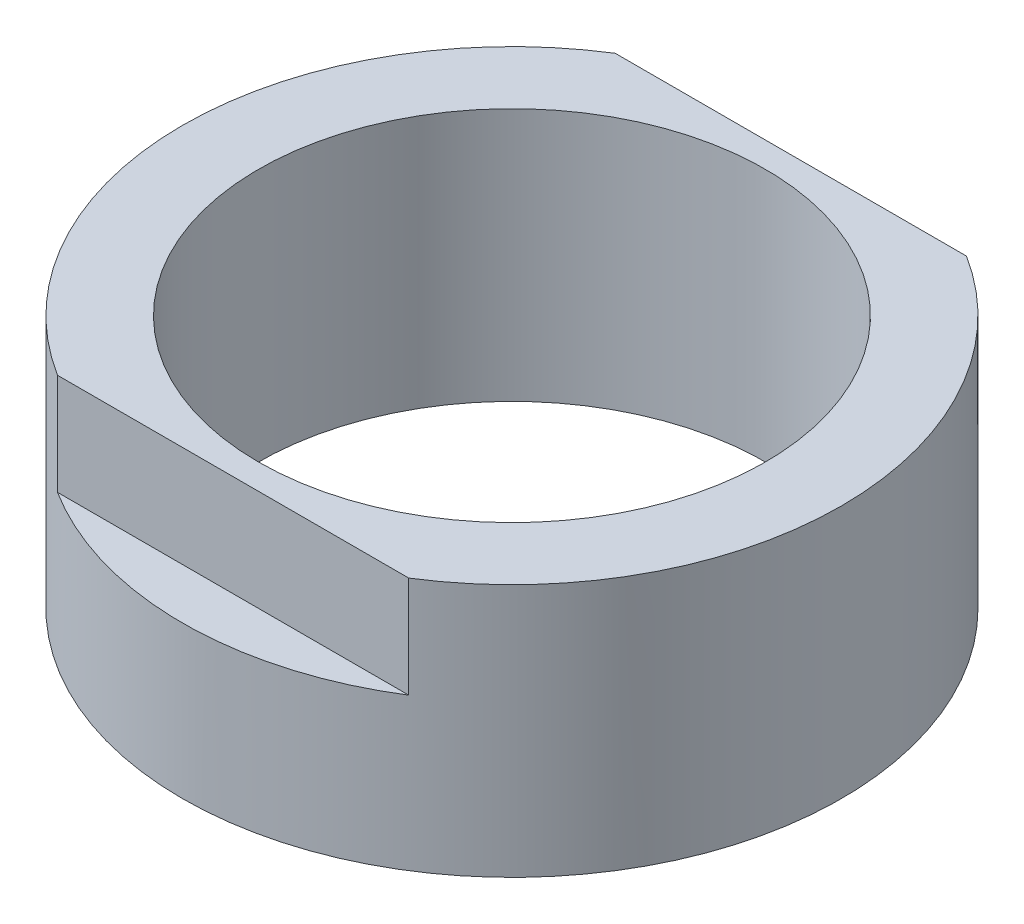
ISO-10303-21;
HEADER;
FILE_DESCRIPTION(('STEP AP214'),'2;1');
FILE_NAME('part.step','',(''),(''),'','','');
FILE_SCHEMA(('AUTOMOTIVE_DESIGN { 1 0 10303 214 1 1 1 1 }'));
ENDSEC;
DATA;
#1=APPLICATION_CONTEXT('core data for automotive mechanical design processes');
#2=APPLICATION_PROTOCOL_DEFINITION('international standard','automotive_design',2000,#1);
#3=PRODUCT_CONTEXT('',#1,'mechanical');
#4=PRODUCT('Part','Part','',(#3));
#5=PRODUCT_RELATED_PRODUCT_CATEGORY('part','',(#4));
#6=PRODUCT_DEFINITION_FORMATION('','',#4);
#7=PRODUCT_DEFINITION_CONTEXT('part definition',#1,'design');
#8=PRODUCT_DEFINITION('design','',#6,#7);
#9=PRODUCT_DEFINITION_SHAPE('','',#8);
#10=(LENGTH_UNIT() NAMED_UNIT(*) SI_UNIT(.MILLI.,.METRE.));
#11=(NAMED_UNIT(*) PLANE_ANGLE_UNIT() SI_UNIT($,.RADIAN.));
#12=(NAMED_UNIT(*) SI_UNIT($,.STERADIAN.) SOLID_ANGLE_UNIT());
#13=UNCERTAINTY_MEASURE_WITH_UNIT(LENGTH_MEASURE(1.E-05),#10,'distance_accuracy_value','');
#14=(GEOMETRIC_REPRESENTATION_CONTEXT(3) GLOBAL_UNCERTAINTY_ASSIGNED_CONTEXT((#13)) GLOBAL_UNIT_ASSIGNED_CONTEXT((#10,
#11,#12)) REPRESENTATION_CONTEXT('',''));
#15=CARTESIAN_POINT('',(0.,0.,0.));
#16=DIRECTION('',(0.,0.,1.));
#17=DIRECTION('',(1.,0.,0.));
#18=AXIS2_PLACEMENT_3D('',#15,#16,#17);
#19=CARTESIAN_POINT('',(0.,5.,0.));
#20=DIRECTION('',(0.,-1.,0.));
#21=DIRECTION('',(0.,0.,-1.));
#22=AXIS2_PLACEMENT_3D('',#19,#20,#21);
#23=CYLINDRICAL_SURFACE('',#22,6.5);
#24=CARTESIAN_POINT('',(0.,5.,0.));
#25=DIRECTION('',(0.,1.,0.));
#26=DIRECTION('',(0.,0.,1.));
#27=AXIS2_PLACEMENT_3D('',#24,#25,#26);
#28=CIRCLE('',#27,6.5);
#29=CARTESIAN_POINT('',(3.46410161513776,5.,5.5));
#30=VERTEX_POINT('',#29);
#31=CARTESIAN_POINT('',(3.46410161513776,5.,-5.5));
#32=VERTEX_POINT('',#31);
#33=EDGE_CURVE('E90',#30,#32,#28,.T.);
#34=ORIENTED_EDGE('',*,*,#33,.F.);
#35=DIRECTION('',(0.,-1.,0.));
#36=VECTOR('',#35,1.);
#37=CARTESIAN_POINT('',(3.46410161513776,5.,5.5));
#38=LINE('',#37,#36);
#39=CARTESIAN_POINT('',(3.46410161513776,3.,5.5));
#40=VERTEX_POINT('',#39);
#41=EDGE_CURVE('E48',#30,#40,#38,.T.);
#42=ORIENTED_EDGE('',*,*,#41,.T.);
#43=CARTESIAN_POINT('',(0.,3.,0.));
#44=DIRECTION('',(0.,1.,0.));
#45=DIRECTION('',(0.,0.,1.));
#46=AXIS2_PLACEMENT_3D('',#43,#44,#45);
#47=CIRCLE('',#46,6.5);
#48=CARTESIAN_POINT('',(-3.46410161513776,3.,5.5));
#49=VERTEX_POINT('',#48);
#50=EDGE_CURVE('E11',#49,#40,#47,.T.);
#51=ORIENTED_EDGE('',*,*,#50,.F.);
#52=DIRECTION('',(0.,-1.,0.));
#53=VECTOR('',#52,1.);
#54=CARTESIAN_POINT('',(-3.46410161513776,5.,5.5));
#55=LINE('',#54,#53);
#56=CARTESIAN_POINT('',(-3.46410161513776,5.,5.5));
#57=VERTEX_POINT('',#56);
#58=EDGE_CURVE('E75',#49,#57,#55,.F.);
#59=ORIENTED_EDGE('',*,*,#58,.T.);
#60=CARTESIAN_POINT('',(-3.46410161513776,5.,-5.5));
#61=VERTEX_POINT('',#60);
#62=EDGE_CURVE('E85',#61,#57,#28,.T.);
#63=ORIENTED_EDGE('',*,*,#62,.F.);
#64=DIRECTION('',(0.,-1.,0.));
#65=VECTOR('',#64,1.);
#66=CARTESIAN_POINT('',(-3.46410161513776,5.,-5.5));
#67=LINE('',#66,#65);
#68=CARTESIAN_POINT('',(-3.46410161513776,3.,-5.5));
#69=VERTEX_POINT('',#68);
#70=EDGE_CURVE('E56',#61,#69,#67,.T.);
#71=ORIENTED_EDGE('',*,*,#70,.T.);
#72=CARTESIAN_POINT('',(0.,3.,0.));
#73=DIRECTION('',(0.,1.,0.));
#74=DIRECTION('',(0.,0.,1.));
#75=AXIS2_PLACEMENT_3D('',#72,#73,#74);
#76=CIRCLE('',#75,6.5);
#77=CARTESIAN_POINT('',(3.46410161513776,3.,-5.5));
#78=VERTEX_POINT('',#77);
#79=EDGE_CURVE('E80',#78,#69,#76,.T.);
#80=ORIENTED_EDGE('',*,*,#79,.F.);
#81=DIRECTION('',(0.,-1.,0.));
#82=VECTOR('',#81,1.);
#83=CARTESIAN_POINT('',(3.46410161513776,5.,-5.5));
#84=LINE('',#83,#82);
#85=EDGE_CURVE('E106',#78,#32,#84,.F.);
#86=ORIENTED_EDGE('',*,*,#85,.T.);
#87=EDGE_LOOP('',(#34,#42,#51,#59,#63,#71,#80,#86));
#88=FACE_BOUND('',#87,.T.);
#89=CARTESIAN_POINT('',(0.,0.,0.));
#90=DIRECTION('',(0.,1.,0.));
#91=DIRECTION('',(0.,0.,1.));
#92=AXIS2_PLACEMENT_3D('',#89,#90,#91);
#93=CIRCLE('',#92,6.5);
#94=CARTESIAN_POINT('',(0.,0.,6.5));
#95=VERTEX_POINT('',#94);
#96=EDGE_CURVE('E93',#95,#95,#93,.T.);
#97=ORIENTED_EDGE('',*,*,#96,.T.);
#98=EDGE_LOOP('',(#97));
#99=FACE_BOUND('',#98,.T.);
#100=ADVANCED_FACE('F34',(#88,#99),#23,.T.);
#101=CARTESIAN_POINT('',(0.,5.,0.));
#102=DIRECTION('',(0.,1.,0.));
#103=DIRECTION('',(0.,0.,1.));
#104=AXIS2_PLACEMENT_3D('',#101,#102,#103);
#105=PLANE('',#104);
#106=CARTESIAN_POINT('',(0.,5.,0.));
#107=DIRECTION('',(0.,1.,0.));
#108=DIRECTION('',(0.,0.,1.));
#109=AXIS2_PLACEMENT_3D('',#106,#107,#108);
#110=CIRCLE('',#109,5.);
#111=CARTESIAN_POINT('',(0.,5.,5.));
#112=VERTEX_POINT('',#111);
#113=EDGE_CURVE('E112',#112,#112,#110,.T.);
#114=ORIENTED_EDGE('',*,*,#113,.F.);
#115=EDGE_LOOP('',(#114));
#116=FACE_BOUND('',#115,.T.);
#117=DIRECTION('',(-1.,0.,0.));
#118=VECTOR('',#117,1.);
#119=CARTESIAN_POINT('',(0.,5.,5.5));
#120=LINE('',#119,#118);
#121=EDGE_CURVE('E41',#30,#57,#120,.T.);
#122=ORIENTED_EDGE('',*,*,#121,.F.);
#123=ORIENTED_EDGE('',*,*,#33,.T.);
#124=DIRECTION('',(1.,0.,0.));
#125=VECTOR('',#124,1.);
#126=CARTESIAN_POINT('',(0.,5.,-5.5));
#127=LINE('',#126,#125);
#128=EDGE_CURVE('E89',#61,#32,#127,.T.);
#129=ORIENTED_EDGE('',*,*,#128,.F.);
#130=ORIENTED_EDGE('',*,*,#62,.T.);
#131=EDGE_LOOP('',(#122,#123,#129,#130));
#132=FACE_BOUND('',#131,.T.);
#133=ADVANCED_FACE('F88',(#116,#132),#105,.T.);
#134=CARTESIAN_POINT('',(0.,0.,0.));
#135=DIRECTION('',(0.,1.,0.));
#136=DIRECTION('',(0.,0.,1.));
#137=AXIS2_PLACEMENT_3D('',#134,#135,#136);
#138=PLANE('',#137);
#139=CARTESIAN_POINT('',(0.,0.,0.));
#140=DIRECTION('',(0.,1.,0.));
#141=DIRECTION('',(0.,0.,1.));
#142=AXIS2_PLACEMENT_3D('',#139,#140,#141);
#143=CIRCLE('',#142,5.);
#144=CARTESIAN_POINT('',(0.,0.,5.));
#145=VERTEX_POINT('',#144);
#146=EDGE_CURVE('E111',#145,#145,#143,.T.);
#147=ORIENTED_EDGE('',*,*,#146,.T.);
#148=EDGE_LOOP('',(#147));
#149=FACE_BOUND('',#148,.T.);
#150=ORIENTED_EDGE('',*,*,#96,.F.);
#151=EDGE_LOOP('',(#150));
#152=FACE_BOUND('',#151,.T.);
#153=ADVANCED_FACE('F118',(#149,#152),#138,.F.);
#154=CARTESIAN_POINT('',(-5.66854749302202,3.,-5.5));
#155=DIRECTION('',(0.,1.,0.));
#156=DIRECTION('',(0.,0.,1.));
#157=AXIS2_PLACEMENT_3D('',#154,#155,#156);
#158=PLANE('',#157);
#159=ORIENTED_EDGE('',*,*,#79,.T.);
#160=DIRECTION('',(1.,0.,0.));
#161=VECTOR('',#160,1.);
#162=CARTESIAN_POINT('',(-5.66854749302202,3.,-5.5));
#163=LINE('',#162,#161);
#164=EDGE_CURVE('E103',#69,#78,#163,.T.);
#165=ORIENTED_EDGE('',*,*,#164,.T.);
#166=EDGE_LOOP('',(#159,#165));
#167=FACE_BOUND('',#166,.T.);
#168=ADVANCED_FACE('F102',(#167),#158,.T.);
#169=CARTESIAN_POINT('',(-5.66854749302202,3.,-5.5));
#170=DIRECTION('',(0.,0.,1.));
#171=DIRECTION('',(1.,0.,0.));
#172=AXIS2_PLACEMENT_3D('',#169,#170,#171);
#173=PLANE('',#172);
#174=ORIENTED_EDGE('',*,*,#128,.T.);
#175=ORIENTED_EDGE('',*,*,#85,.F.);
#176=ORIENTED_EDGE('',*,*,#164,.F.);
#177=ORIENTED_EDGE('',*,*,#70,.F.);
#178=EDGE_LOOP('',(#174,#175,#176,#177));
#179=FACE_BOUND('',#178,.T.);
#180=ADVANCED_FACE('F105',(#179),#173,.F.);
#181=CARTESIAN_POINT('',(-5.40170878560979,3.,8.5));
#182=DIRECTION('',(0.,1.,0.));
#183=DIRECTION('',(0.,0.,1.));
#184=AXIS2_PLACEMENT_3D('',#181,#182,#183);
#185=PLANE('',#184);
#186=ORIENTED_EDGE('',*,*,#50,.T.);
#187=DIRECTION('',(-1.,0.,0.));
#188=VECTOR('',#187,1.);
#189=CARTESIAN_POINT('',(-5.40170878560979,3.,5.5));
#190=LINE('',#189,#188);
#191=EDGE_CURVE('E86',#40,#49,#190,.T.);
#192=ORIENTED_EDGE('',*,*,#191,.T.);
#193=EDGE_LOOP('',(#186,#192));
#194=FACE_BOUND('',#193,.T.);
#195=ADVANCED_FACE('F136',(#194),#185,.T.);
#196=CARTESIAN_POINT('',(-5.40170878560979,3.,5.5));
#197=DIRECTION('',(0.,0.,-1.));
#198=DIRECTION('',(-1.,0.,0.));
#199=AXIS2_PLACEMENT_3D('',#196,#197,#198);
#200=PLANE('',#199);
#201=ORIENTED_EDGE('',*,*,#121,.T.);
#202=ORIENTED_EDGE('',*,*,#58,.F.);
#203=ORIENTED_EDGE('',*,*,#191,.F.);
#204=ORIENTED_EDGE('',*,*,#41,.F.);
#205=EDGE_LOOP('',(#201,#202,#203,#204));
#206=FACE_BOUND('',#205,.T.);
#207=ADVANCED_FACE('F74',(#206),#200,.F.);
#208=CARTESIAN_POINT('',(0.,0.,0.));
#209=DIRECTION('',(0.,1.,0.));
#210=DIRECTION('',(0.,0.,1.));
#211=AXIS2_PLACEMENT_3D('',#208,#209,#210);
#212=CYLINDRICAL_SURFACE('',#211,5.);
#213=ORIENTED_EDGE('',*,*,#146,.F.);
#214=EDGE_LOOP('',(#213));
#215=FACE_BOUND('',#214,.T.);
#216=ORIENTED_EDGE('',*,*,#113,.T.);
#217=EDGE_LOOP('',(#216));
#218=FACE_BOUND('',#217,.T.);
#219=ADVANCED_FACE('F121',(#215,#218),#212,.F.);
#220=CLOSED_SHELL('',(#100,#133,#153,#168,#180,#195,#207,#219));
#221=MANIFOLD_SOLID_BREP('B2',#220);
#222=ADVANCED_BREP_SHAPE_REPRESENTATION('',(#18,#221),#14);
#223=SHAPE_DEFINITION_REPRESENTATION(#9,#222);
ENDSEC;
END-ISO-10303-21;
